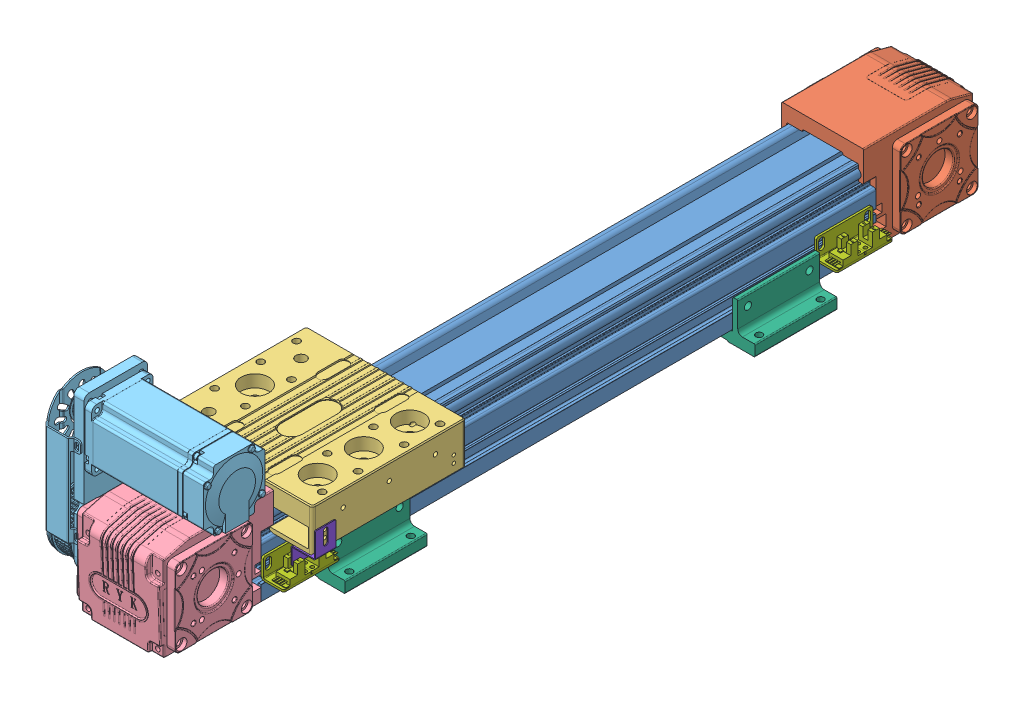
SolidWorks assembly RYK80-转折.SLDASM, configuration 默认 (file format 9000). Lengths in mm.
Overall size (163.5 185 803.37).
15 component instances, 10 part files, 44 mates.
Components (placement in the parent):
- RYK80欧规皮带模组型材底座-1: RYK80欧规皮带模组型材底座.SLDPRT [默认] at (-214.5114 -116.5275 500) size (80 74.5 600)
- RYK80-欧规副同步座-1: RYK80-欧规副同步座.SLDPRT [默认] at (-25.626 6.7076 546) x (-1 0 0) z (0 0 -1) size (96.14 90.46 113.69)
- RYK80欧规同步带模组滑块-1: RYK80欧规同步带模组滑块.SLDPRT [默认] at (-48.6835 40.0257 857) size (156 41.56 150)
- RYK80-欧规主同步端-1A出轴-1: RYK80-欧规主同步端-1A出轴.SLDPRT [默认] at (-45.0567 6.7076 1054) size (124.16 90.46 113.69)
- RYK80欧规模组转折同步带-1: RYK80欧规模组转折同步带.SLDPRT [默认] at (-93.3413 57.3679 1154) x (0 0 -1) z (1 0 0) size (71 162 155)
- RYK80-欧规主同步端-2B出轴-1: RYK80-欧规主同步端-2B出轴.SLDPRT [默认] at (-45.0567 6.7076 1054) (suppressed, hidden)
- RYK80欧规模组转折同步带-2: RYK80欧规模组转折同步带.SLDPRT [默认] at (22.6587 57.3679 1154) x (0 0 1) z (-1 0 0) size (71 162 155) (suppressed, hidden)
- RYK80-欧规主同步端-双出轴-1: RYK80-欧规主同步端-双出轴.SLDPRT [默认] at (-45.0567 6.7076 1054) (suppressed, hidden)
- RYK80欧规模组转折同步带-4: RYK80欧规模组转折同步带.SLDPRT [默认] at (-93.3413 57.3679 1154) x (0 0 -1) z (1 0 0) size (71 162 155) (suppressed, hidden)
- RYK80欧规模组转折同步带-5: RYK80欧规模组转折同步带.SLDPRT [默认] at (22.6587 57.3679 1154) x (0 0 1) z (-1 0 0) size (71 162 155) (suppressed, hidden)
- RY80欧规地脚-1: RY80欧规地脚.SLDPRT [默认] at (-35.3413 -46.6321 1040) x (0 0 -1) z (1 0 0) size (80 40 124)
- RY80欧规地脚-2: RY80欧规地脚.SLDPRT [默认] at (-35.3413 -46.6321 640) x (0 0 -1) z (1 0 0) size (80 40 124)
- RYK60 欧规光电安装座-1: RYK60 欧规光电安装座.SLDPRT [默认] at (-55.7216 6.9235 1517.0757) x (-1 0 0) z (0 0 -1) size (22 20 55.4)
- 80欧规光电感应片-1: 80欧规光电感应片.SLDPRT [默认] at (43.6587 36.8679 1066) x (0 0 1) z (-1 0 0) size (20 41 24)
- RYK60 欧规光电安装座-2: RYK60 欧规光电安装座.SLDPRT [默认] at (-55.7216 6.9235 977.0757) x (-1 0 0) z (0 0 -1) size (22 20 55.4)
Mates (geometry in assembly coordinates):
- 重合1: coincident anti-aligned: plane of RYK80欧规皮带模组型材底座-1 through (-55.0601 28.8679 1100) normal (0 0 1); plane of RYK80-欧规主同步端-2B出轴-1 through (-35.3413 -36.6321 1100) normal (0 0 -1)
- 宽度1: width aligned: plane of RYK80欧规皮带模组型材底座-1 through (4.6586 -35.1321 1100) normal (1 0 0); plane of RYK80欧规皮带模组型材底座-1 through (-75.3413 -20.9321 1100) normal (-1 0 0); plane of RYK80-欧规主同步端-2B出轴-1 through (4.6587 -36.6321 1192) normal (1 0 0); plane of RYK80-欧规主同步端-2B出轴-1 through (-75.3413 -36.6321 1192) normal (-1 0 0)
- 重合9: coincident aligned: plane of RYK80欧规皮带模组型材底座-1 through (-63.5413 -36.6321 1100) normal (0 -1 0); plane of RYK80-欧规主同步端-2B出轴-1 through (-35.3413 -36.6321 1192) normal (0 -1 0)
- 重合10: coincident aligned: plane of RYK80欧规皮带模组型材底座-1 through (-63.5413 -36.6321 1100) normal (0 -1 0); plane of RYK80-欧规主同步端-双出轴-1 through (-35.3413 -36.6321 1192) normal (0 -1 0)
- 宽度2: width aligned: plane of RYK80欧规皮带模组型材底座-1 through (-75.3413 -20.9321 1100) normal (-1 0 0); plane of RYK80欧规皮带模组型材底座-1 through (4.6586 -35.1321 1100) normal (1 0 0); plane of RYK80-欧规主同步端-双出轴-1 through (-75.3413 -36.6321 1192) normal (-1 0 0); plane of RYK80-欧规主同步端-双出轴-1 through (4.6587 -36.6321 1192) normal (1 0 0)
- 重合11: coincident anti-aligned: plane of RYK80欧规皮带模组型材底座-1 through (-55.0601 28.8679 1100) normal (0 0 1); plane of RYK80-欧规主同步端-双出轴-1 through (-35.3413 -36.6321 1100) normal (0 0 -1)
- 重合12: coincident anti-aligned: plane of RYK80欧规皮带模组型材底座-1 through (-55.0601 28.8679 1100) normal (0 0 1); plane of RYK80-欧规主同步端-1A出轴-1 through (-35.3413 -36.6321 1100) normal (0 0 -1)
- 宽度3: width anti-aligned: plane of RYK80欧规皮带模组型材底座-1 through (4.6586 -35.1321 1100) normal (1 0 0); plane of RYK80欧规皮带模组型材底座-1 through (-75.3413 -20.9321 1100) normal (-1 0 0); plane of RYK80-欧规主同步端-1A出轴-1 through (-75.3413 -36.6321 1192) normal (-1 0 0); plane of RYK80-欧规主同步端-1A出轴-1 through (4.6587 -36.6321 1192) normal (1 0 0)
- 重合13: coincident aligned: plane of RYK80欧规皮带模组型材底座-1 through (-63.5413 -36.6321 1100) normal (0 -1 0); plane of RYK80-欧规主同步端-1A出轴-1 through (-35.3413 -36.6321 1192) normal (0 -1 0)
- 重合14: coincident anti-aligned: plane of RYK80欧规皮带模组型材底座-1 through (-55.0601 28.8679 500) normal (0 0 -1); plane of RYK80-欧规副同步座-1 through (-35.3413 -36.6321 500) normal (0 0 1)
- 重合15: coincident aligned: plane of RYK80欧规皮带模组型材底座-1 through (-21.3414 -36.6321 1100) normal (0 -1 0); plane of RYK80-欧规副同步座-1 through (-35.3413 -36.6321 408) normal (0 -1 0)
- 宽度4: width anti-aligned: plane of RYK80欧规皮带模组型材底座-1 through (4.6586 -35.1321 1100) normal (1 0 0); plane of RYK80欧规皮带模组型材底座-1 through (-75.3413 -20.9321 1100) normal (-1 0 0); plane of RYK80-欧规副同步座-1 through (-75.3413 -36.6321 408) normal (-1 0 0); plane of RYK80-欧规副同步座-1 through (4.6587 -36.6321 408) normal (1 0 0)
- 重合16: coincident anti-aligned: plane of RYK80欧规皮带模组型材底座-1 through (-63.5413 -36.6321 1100) normal (0 -1 0); plane of RY80欧规地脚-1 through (-75.4913 -36.6321 960) normal (0 1 0)
- 宽度5: width anti-aligned: plane of RY80欧规地脚-1 through (9.8087 -36.6321 960) normal (1 0 0); plane of RY80欧规地脚-1 through (-80.4913 -36.6321 960) normal (-1 0 0); plane of RYK80欧规皮带模组型材底座-1 through (-75.3413 -20.9321 1100) normal (-1 0 0); plane of RYK80欧规皮带模组型材底座-1 through (4.6586 -35.1321 1100) normal (1 0 0)
- 重合17: coincident aligned: plane of RY80欧规地脚-1 through (9.8087 -36.6321 960) normal (1 0 0); plane of RY80欧规地脚-2 through (9.8087 -36.6321 560) normal (1 0 0)
- 重合18: coincident aligned: plane of RY80欧规地脚-1 through (0.3589 -47.6321 960) normal (0 -1 0); plane of RY80欧规地脚-2 through (0.3589 -47.6321 560) normal (0 -1 0)
- 距离3: distance = 60 mm aligned: plane of RYK80欧规皮带模组型材底座-1 through (-55.0601 28.8679 1100) normal (0 0 1); plane of RY80欧规地脚-1 through (-35.3413 -46.6321 1040) normal (0 0 1)
- 距离4: distance = 60 mm aligned: plane of RYK80欧规皮带模组型材底座-1 through (-55.0601 28.8679 500) normal (0 0 -1); plane of RY80欧规地脚-2 through (-35.3413 -46.6321 560) normal (0 0 -1)
- 重合24: coincident anti-aligned: plane of RYK80欧规皮带模组型材底座-1 through (4.6586 -35.1321 1100) normal (1 0 0); plane of RYK60 欧规光电安装座-1 through (4.6586 3.3679 1045) normal (-1 0 0)
- 距离7: distance = 20 mm aligned: plane of RYK60 欧规光电安装座-1 through (4.6586 -16.6321 1045) normal (0 -1 0); plane of RYK80欧规皮带模组型材底座-1 through (-21.3414 -36.6321 1100) normal (0 -1 0)
- 重合32: coincident aligned: plane of RYK60 欧规光电安装座-1 through (4.6586 -16.6321 1045) normal (0 -1 0); plane of RYK60 欧规光电安装座-2 through (4.6586 -16.6321 505) normal (0 -1 0)
- 重合33: coincident aligned: plane of RYK60 欧规光电安装座-1 through (26.6586 -16.6321 1045) normal (1 0 0); plane of RYK60 欧规光电安装座-2 through (26.6586 -16.6321 505) normal (1 0 0)
- 距离8: distance = 5 mm aligned: plane of RYK60 欧规光电安装座-2 through (6.6586 -13.8955 505) normal (0 0 -1); plane of RYK80欧规皮带模组型材底座-1 through (-55.0601 28.8679 500) normal (0 0 -1)
- 距离9: distance = 105.5 mm anti-aligned: plane of RYK80欧规同步带模组滑块-1 through (-117.8382 57.8679 940.5) normal (0 1 0); plane of RY80欧规地脚-1 through (-71.0415 -47.6321 960) normal (0 -1 0)
- 宽度6: width aligned: plane of RYK80欧规同步带模组滑块-1 through (-113.3413 35.9974 1085.5) normal (-1 0 0); plane of RYK80欧规同步带模组滑块-1 through (42.6587 17.8079 1085.5) normal (1 0 0); plane of RYK80欧规皮带模组型材底座-1 through (-75.3413 -20.9321 1100) normal (-1 0 0); plane of RYK80欧规皮带模组型材底座-1 through (4.6586 -35.1321 1100) normal (1 0 0)
- 重合39: coincident anti-aligned: plane of RYK80欧规同步带模组滑块-1 through (-104.3413 47.7679 1088) normal (0 0 1); plane of RYK80-欧规主同步端-1A出轴-1 through (-35.3413 38.3679 1088) normal (0 0 -1)
- 重合40: coincident anti-aligned: plane of RYK80欧规同步带模组滑块-1 through (42.6587 17.8079 1085.5) normal (1 0 0); plane of 80欧规光电感应片-1 through (42.6587 36.8679 1086) normal (-1 0 0)
- 距离10: distance = 2 mm aligned: plane of 80欧规光电感应片-1 through (21.3953 11.1313 1086) normal (0 0 1); plane of RYK80欧规同步带模组滑块-1 through (-104.3413 47.7679 1088) normal (0 0 1)
- 距离11: distance = 21 mm aligned: plane of 80欧规光电感应片-1 through (42.6587 36.8679 1086) normal (0 1 0); plane of RYK80欧规同步带模组滑块-1 through (-117.8382 57.8679 940.5) normal (0 1 0)
- 重合44: coincident anti-aligned: plane of RYK80欧规同步带模组滑块-1 through (-104.3413 47.7679 1088) normal (0 0 1); plane of RYK80-欧规主同步端-2B出轴-1 through (-35.3413 38.3679 1088) normal (0 0 -1)
- 重合48: coincident anti-aligned: plane of RYK80欧规同步带模组滑块-1 through (-104.3413 47.7679 1088) normal (0 0 1); plane of RYK80-欧规主同步端-双出轴-1 through (-35.3413 38.3679 1088) normal (0 0 -1)
- 重合49: coincident aligned: plane of RYK80欧规皮带模组型材底座-1 through (-55.0601 28.8679 1100) normal (0 0 1); plane of RYK60 欧规光电安装座-1 through (7.3952 -13.8955 1100) normal (0 0 1)
- 重合50: coincident anti-aligned: plane of RYK80-欧规主同步端-1A出轴-1 through (-83.3413 7.3679 1154) normal (-1 0 0); plane of RYK80欧规模组转折同步带-1 through (-83.3413 57.3679 1154) normal (1 0 0)
- 同心1: concentric anti-aligned: cylinder of RYK80-欧规主同步端-1A出轴-1 through (-111.3413 7.3679 1154) axis (1 0 0) radius 9.5; cylinder of RYK80欧规模组转折同步带-1 through (-83.3413 7.3679 1154) axis (-1 0 0) radius 15
- 平行1: parallel aligned: plane of RYK80-欧规主同步端-1A出轴-1 through (-35.3413 -36.6321 1192) normal (0 -1 0); plane of RYK80欧规模组转折同步带-1 through (-83.3413 -22.6321 1185) normal (0 -1 0)
- 同心2: concentric anti-aligned: cylinder of RYK80-欧规主同步端-2B出轴-1 through (40.6587 7.3679 1154) axis (-1 0 0) radius 9.5; cylinder of RYK80欧规模组转折同步带-2 through (12.6587 7.3679 1154) axis (1 0 0) radius 15
- 重合52: coincident anti-aligned: plane of RYK80-欧规主同步端-2B出轴-1 through (12.6587 7.3679 1154) normal (1 0 0); plane of RYK80欧规模组转折同步带-2 through (12.6587 57.3679 1154) normal (-1 0 0)
- 平行3: parallel aligned: plane of RYK80欧规同步带模组滑块-1 through (-117.8382 57.8679 940.5) normal (0 1 0); plane of RYK80欧规模组转折同步带-2 through (12.6587 137.3679 1123) normal (0 1 0)
- 同心3: concentric anti-aligned: cylinder of RYK80-欧规主同步端-双出轴-1 through (40.6587 7.3679 1154) axis (-1 0 0) radius 9.5; cylinder of RYK80欧规模组转折同步带-5 through (12.6587 7.3679 1154) axis (1 0 0) radius 15
- 重合56: coincident anti-aligned: plane of RYK80-欧规主同步端-双出轴-1 through (12.6587 7.3679 1154) normal (1 0 0); plane of RYK80欧规模组转折同步带-5 through (12.6587 57.3679 1154) normal (-1 0 0)
- 平行4: parallel aligned: plane of RYK80欧规同步带模组滑块-1 through (-117.8382 57.8679 940.5) normal (0 1 0); plane of RYK80欧规模组转折同步带-5 through (12.6587 137.3679 1123) normal (0 1 0)
- 同心5: concentric anti-aligned: cylinder of RYK80-欧规主同步端-双出轴-1 through (-111.3413 7.3679 1154) axis (1 0 0) radius 9.5; cylinder of RYK80欧规模组转折同步带-4 through (-83.3413 7.3679 1154) axis (-1 0 0) radius 15
- 重合59: coincident anti-aligned: plane of RYK80-欧规主同步端-双出轴-1 through (-83.3413 7.3679 1154) normal (-1 0 0); plane of RYK80欧规模组转折同步带-4 through (-83.3413 57.3679 1154) normal (1 0 0)
- 平行6: parallel aligned: plane of RYK80欧规同步带模组滑块-1 through (-117.8382 57.8679 940.5) normal (0 1 0); plane of RYK80欧规模组转折同步带-4 through (-83.3413 137.3679 1185) normal (0 1 0)
